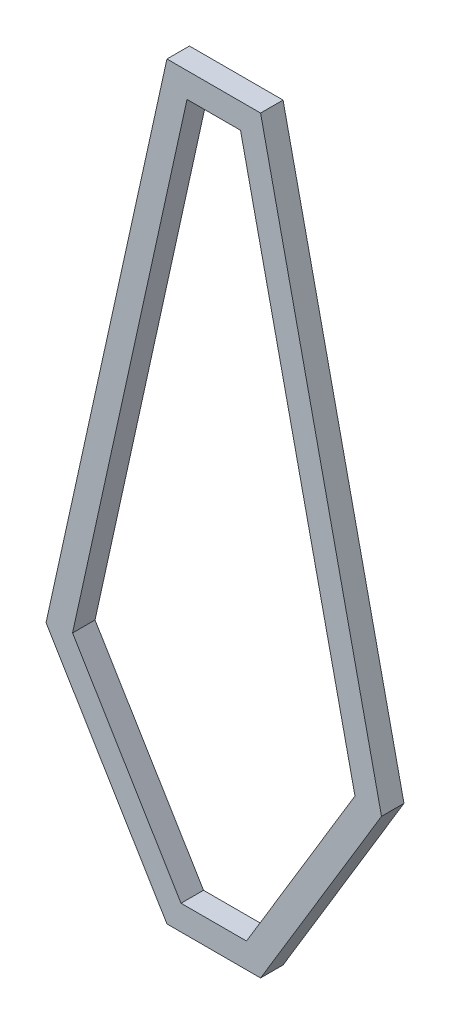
ISO-10303-21;
HEADER;
FILE_DESCRIPTION(('STEP AP214'),'2;1');
FILE_NAME('part.step','',(''),(''),'','','');
FILE_SCHEMA(('AUTOMOTIVE_DESIGN { 1 0 10303 214 1 1 1 1 }'));
ENDSEC;
DATA;
#1=APPLICATION_CONTEXT('core data for automotive mechanical design processes');
#2=APPLICATION_PROTOCOL_DEFINITION('international standard','automotive_design',2000,#1);
#3=PRODUCT_CONTEXT('',#1,'mechanical');
#4=PRODUCT('Part','Part','',(#3));
#5=PRODUCT_RELATED_PRODUCT_CATEGORY('part','',(#4));
#6=PRODUCT_DEFINITION_FORMATION('','',#4);
#7=PRODUCT_DEFINITION_CONTEXT('part definition',#1,'design');
#8=PRODUCT_DEFINITION('design','',#6,#7);
#9=PRODUCT_DEFINITION_SHAPE('','',#8);
#10=(LENGTH_UNIT() NAMED_UNIT(*) SI_UNIT(.MILLI.,.METRE.));
#11=(NAMED_UNIT(*) PLANE_ANGLE_UNIT() SI_UNIT($,.RADIAN.));
#12=(NAMED_UNIT(*) SI_UNIT($,.STERADIAN.) SOLID_ANGLE_UNIT());
#13=UNCERTAINTY_MEASURE_WITH_UNIT(LENGTH_MEASURE(1.E-05),#10,'distance_accuracy_value','');
#14=(GEOMETRIC_REPRESENTATION_CONTEXT(3) GLOBAL_UNCERTAINTY_ASSIGNED_CONTEXT((#13)) GLOBAL_UNIT_ASSIGNED_CONTEXT((#10,
#11,#12)) REPRESENTATION_CONTEXT('',''));
#15=CARTESIAN_POINT('',(0.,0.,0.));
#16=DIRECTION('',(0.,0.,1.));
#17=DIRECTION('',(1.,0.,0.));
#18=AXIS2_PLACEMENT_3D('',#15,#16,#17);
#19=CARTESIAN_POINT('',(-37.5,0.,18.));
#20=DIRECTION('',(0.9765625,-0.215234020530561,0.));
#21=DIRECTION('',(0.215234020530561,0.9765625,0.));
#22=AXIS2_PLACEMENT_3D('',#19,#20,#21);
#23=PLANE('',#22);
#24=DIRECTION('',(-0.215234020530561,-0.9765625,0.));
#25=VECTOR('',#24,1.);
#26=CARTESIAN_POINT('',(-37.5,0.,0.));
#27=LINE('',#26,#25);
#28=CARTESIAN_POINT('',(-37.5,0.,0.));
#29=VERTEX_POINT('',#28);
#30=CARTESIAN_POINT('',(-134.355309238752,-439.453125,0.));
#31=VERTEX_POINT('',#30);
#32=EDGE_CURVE('E169',#29,#31,#27,.T.);
#33=ORIENTED_EDGE('',*,*,#32,.T.);
#34=DIRECTION('',(0.,0.,-1.));
#35=VECTOR('',#34,1.);
#36=CARTESIAN_POINT('',(-134.355309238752,-439.453125,18.));
#37=LINE('',#36,#35);
#38=CARTESIAN_POINT('',(-134.355309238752,-439.453125,18.));
#39=VERTEX_POINT('',#38);
#40=EDGE_CURVE('E11',#39,#31,#37,.T.);
#41=ORIENTED_EDGE('',*,*,#40,.F.);
#42=DIRECTION('',(-0.215234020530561,-0.9765625,0.));
#43=VECTOR('',#42,1.);
#44=CARTESIAN_POINT('',(-37.5,0.,18.));
#45=LINE('',#44,#43);
#46=CARTESIAN_POINT('',(-37.5,0.,18.));
#47=VERTEX_POINT('',#46);
#48=EDGE_CURVE('E177',#47,#39,#45,.T.);
#49=ORIENTED_EDGE('',*,*,#48,.F.);
#50=DIRECTION('',(0.,0.,-1.));
#51=VECTOR('',#50,1.);
#52=CARTESIAN_POINT('',(-37.5,0.,18.));
#53=LINE('',#52,#51);
#54=EDGE_CURVE('E191',#47,#29,#53,.T.);
#55=ORIENTED_EDGE('',*,*,#54,.T.);
#56=EDGE_LOOP('',(#33,#41,#49,#55));
#57=FACE_BOUND('',#56,.T.);
#58=ADVANCED_FACE('F36',(#57),#23,.F.);
#59=CARTESIAN_POINT('',(-134.355309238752,-439.453125,18.));
#60=DIRECTION('',(0.85625,0.516561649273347,0.));
#61=DIRECTION('',(-0.516561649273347,0.85625,0.));
#62=AXIS2_PLACEMENT_3D('',#59,#60,#61);
#63=PLANE('',#62);
#64=DIRECTION('',(0.516561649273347,-0.85625,0.));
#65=VECTOR('',#64,1.);
#66=CARTESIAN_POINT('',(-134.355309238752,-439.453125,0.));
#67=LINE('',#66,#65);
#68=CARTESIAN_POINT('',(-37.4999999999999,-600.,0.));
#69=VERTEX_POINT('',#68);
#70=EDGE_CURVE('E194',#31,#69,#67,.T.);
#71=ORIENTED_EDGE('',*,*,#70,.T.);
#72=DIRECTION('',(0.,0.,-1.));
#73=VECTOR('',#72,1.);
#74=CARTESIAN_POINT('',(-37.4999999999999,-600.,18.));
#75=LINE('',#74,#73);
#76=CARTESIAN_POINT('',(-37.4999999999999,-600.,18.));
#77=VERTEX_POINT('',#76);
#78=EDGE_CURVE('E43',#77,#69,#75,.T.);
#79=ORIENTED_EDGE('',*,*,#78,.F.);
#80=DIRECTION('',(0.516561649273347,-0.85625,0.));
#81=VECTOR('',#80,1.);
#82=CARTESIAN_POINT('',(-134.355309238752,-439.453125,18.));
#83=LINE('',#82,#81);
#84=EDGE_CURVE('E180',#39,#77,#83,.T.);
#85=ORIENTED_EDGE('',*,*,#84,.F.);
#86=ORIENTED_EDGE('',*,*,#40,.T.);
#87=EDGE_LOOP('',(#71,#79,#85,#86));
#88=FACE_BOUND('',#87,.T.);
#89=ADVANCED_FACE('F239',(#88),#63,.F.);
#90=CARTESIAN_POINT('',(37.5000000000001,-600.,18.));
#91=DIRECTION('',(0.,1.,0.));
#92=DIRECTION('',(0.,0.,1.));
#93=AXIS2_PLACEMENT_3D('',#90,#91,#92);
#94=PLANE('',#93);
#95=DIRECTION('',(1.,0.,0.));
#96=VECTOR('',#95,1.);
#97=CARTESIAN_POINT('',(37.5000000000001,-600.,0.));
#98=LINE('',#97,#96);
#99=CARTESIAN_POINT('',(37.5000000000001,-600.,0.));
#100=VERTEX_POINT('',#99);
#101=EDGE_CURVE('E196',#69,#100,#98,.T.);
#102=ORIENTED_EDGE('',*,*,#101,.T.);
#103=DIRECTION('',(0.,0.,-1.));
#104=VECTOR('',#103,1.);
#105=CARTESIAN_POINT('',(37.5000000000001,-600.,18.));
#106=LINE('',#105,#104);
#107=CARTESIAN_POINT('',(37.5000000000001,-600.,18.));
#108=VERTEX_POINT('',#107);
#109=EDGE_CURVE('E211',#108,#100,#106,.T.);
#110=ORIENTED_EDGE('',*,*,#109,.F.);
#111=DIRECTION('',(1.,0.,0.));
#112=VECTOR('',#111,1.);
#113=CARTESIAN_POINT('',(37.5000000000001,-600.,18.));
#114=LINE('',#113,#112);
#115=EDGE_CURVE('E183',#77,#108,#114,.T.);
#116=ORIENTED_EDGE('',*,*,#115,.F.);
#117=ORIENTED_EDGE('',*,*,#78,.T.);
#118=EDGE_LOOP('',(#102,#110,#116,#117));
#119=FACE_BOUND('',#118,.T.);
#120=ADVANCED_FACE('F218',(#119),#94,.F.);
#121=CARTESIAN_POINT('',(134.355309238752,-439.453125,18.));
#122=DIRECTION('',(-0.85625,0.516561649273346,0.));
#123=DIRECTION('',(-0.516561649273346,-0.85625,0.));
#124=AXIS2_PLACEMENT_3D('',#121,#122,#123);
#125=PLANE('',#124);
#126=DIRECTION('',(0.516561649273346,0.85625,0.));
#127=VECTOR('',#126,1.);
#128=CARTESIAN_POINT('',(134.355309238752,-439.453125,0.));
#129=LINE('',#128,#127);
#130=CARTESIAN_POINT('',(134.355309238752,-439.453125,0.));
#131=VERTEX_POINT('',#130);
#132=EDGE_CURVE('E198',#100,#131,#129,.T.);
#133=ORIENTED_EDGE('',*,*,#132,.T.);
#134=DIRECTION('',(0.,0.,-1.));
#135=VECTOR('',#134,1.);
#136=CARTESIAN_POINT('',(134.355309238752,-439.453125,18.));
#137=LINE('',#136,#135);
#138=CARTESIAN_POINT('',(134.355309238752,-439.453125,18.));
#139=VERTEX_POINT('',#138);
#140=EDGE_CURVE('E208',#139,#131,#137,.T.);
#141=ORIENTED_EDGE('',*,*,#140,.F.);
#142=DIRECTION('',(0.516561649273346,0.85625,0.));
#143=VECTOR('',#142,1.);
#144=CARTESIAN_POINT('',(134.355309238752,-439.453125,18.));
#145=LINE('',#144,#143);
#146=EDGE_CURVE('E185',#108,#139,#145,.T.);
#147=ORIENTED_EDGE('',*,*,#146,.F.);
#148=ORIENTED_EDGE('',*,*,#109,.T.);
#149=EDGE_LOOP('',(#133,#141,#147,#148));
#150=FACE_BOUND('',#149,.T.);
#151=ADVANCED_FACE('F227',(#150),#125,.F.);
#152=CARTESIAN_POINT('',(37.5,0.,18.));
#153=DIRECTION('',(-0.9765625,-0.215234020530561,0.));
#154=DIRECTION('',(0.215234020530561,-0.9765625,0.));
#155=AXIS2_PLACEMENT_3D('',#152,#153,#154);
#156=PLANE('',#155);
#157=DIRECTION('',(-0.215234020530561,0.9765625,0.));
#158=VECTOR('',#157,1.);
#159=CARTESIAN_POINT('',(37.5,0.,0.));
#160=LINE('',#159,#158);
#161=CARTESIAN_POINT('',(37.5,0.,0.));
#162=VERTEX_POINT('',#161);
#163=EDGE_CURVE('E200',#131,#162,#160,.T.);
#164=ORIENTED_EDGE('',*,*,#163,.T.);
#165=DIRECTION('',(0.,0.,-1.));
#166=VECTOR('',#165,1.);
#167=CARTESIAN_POINT('',(37.5,0.,18.));
#168=LINE('',#167,#166);
#169=CARTESIAN_POINT('',(37.5,0.,18.));
#170=VERTEX_POINT('',#169);
#171=EDGE_CURVE('E205',#170,#162,#168,.T.);
#172=ORIENTED_EDGE('',*,*,#171,.F.);
#173=DIRECTION('',(-0.215234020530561,0.9765625,0.));
#174=VECTOR('',#173,1.);
#175=CARTESIAN_POINT('',(37.5,0.,18.));
#176=LINE('',#175,#174);
#177=EDGE_CURVE('E187',#139,#170,#176,.T.);
#178=ORIENTED_EDGE('',*,*,#177,.F.);
#179=ORIENTED_EDGE('',*,*,#140,.T.);
#180=EDGE_LOOP('',(#164,#172,#178,#179));
#181=FACE_BOUND('',#180,.T.);
#182=ADVANCED_FACE('F231',(#181),#156,.F.);
#183=CARTESIAN_POINT('',(37.5,0.,18.));
#184=DIRECTION('',(0.,-1.,0.));
#185=DIRECTION('',(1.,0.,0.));
#186=AXIS2_PLACEMENT_3D('',#183,#184,#185);
#187=PLANE('',#186);
#188=DIRECTION('',(-1.,0.,0.));
#189=VECTOR('',#188,1.);
#190=CARTESIAN_POINT('',(37.5,0.,0.));
#191=LINE('',#190,#189);
#192=EDGE_CURVE('E181',#162,#29,#191,.T.);
#193=ORIENTED_EDGE('',*,*,#192,.T.);
#194=ORIENTED_EDGE('',*,*,#54,.F.);
#195=DIRECTION('',(-1.,0.,0.));
#196=VECTOR('',#195,1.);
#197=CARTESIAN_POINT('',(37.5,0.,18.));
#198=LINE('',#197,#196);
#199=EDGE_CURVE('E189',#170,#47,#198,.T.);
#200=ORIENTED_EDGE('',*,*,#199,.F.);
#201=ORIENTED_EDGE('',*,*,#171,.T.);
#202=EDGE_LOOP('',(#193,#194,#200,#201));
#203=FACE_BOUND('',#202,.T.);
#204=ADVANCED_FACE('F242',(#203),#187,.F.);
#205=CARTESIAN_POINT('',(0.,0.,18.));
#206=DIRECTION('',(0.,0.,-1.));
#207=DIRECTION('',(-1.,0.,0.));
#208=AXIS2_PLACEMENT_3D('',#205,#206,#207);
#209=PLANE('',#208);
#210=DIRECTION('',(-0.215234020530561,-0.9765625,0.));
#211=VECTOR('',#210,1.);
#212=CARTESIAN_POINT('',(-21.4279927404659,-20.,18.));
#213=LINE('',#212,#211);
#214=CARTESIAN_POINT('',(-21.4279927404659,-20.,18.));
#215=VERTEX_POINT('',#214);
#216=CARTESIAN_POINT('',(-113.105309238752,-435.959471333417,18.));
#217=VERTEX_POINT('',#216);
#218=EDGE_CURVE('E157',#215,#217,#213,.T.);
#219=ORIENTED_EDGE('',*,*,#218,.F.);
#220=DIRECTION('',(-1.,0.,0.));
#221=VECTOR('',#220,1.);
#222=CARTESIAN_POINT('',(21.4279927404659,-20.,18.));
#223=LINE('',#222,#221);
#224=CARTESIAN_POINT('',(21.4279927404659,-20.,18.));
#225=VERTEX_POINT('',#224);
#226=EDGE_CURVE('E50',#225,#215,#223,.T.);
#227=ORIENTED_EDGE('',*,*,#226,.F.);
#228=DIRECTION('',(-0.215234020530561,0.9765625,0.));
#229=VECTOR('',#228,1.);
#230=CARTESIAN_POINT('',(113.105309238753,-435.959471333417,18.));
#231=LINE('',#230,#229);
#232=CARTESIAN_POINT('',(113.105309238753,-435.959471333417,18.));
#233=VERTEX_POINT('',#232);
#234=EDGE_CURVE('E143',#233,#225,#231,.T.);
#235=ORIENTED_EDGE('',*,*,#234,.F.);
#236=DIRECTION('',(0.516561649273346,0.85625,0.));
#237=VECTOR('',#236,1.);
#238=CARTESIAN_POINT('',(26.2080093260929,-580.,18.));
#239=LINE('',#238,#237);
#240=CARTESIAN_POINT('',(26.2080093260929,-580.,18.));
#241=VERTEX_POINT('',#240);
#242=EDGE_CURVE('E146',#241,#233,#239,.T.);
#243=ORIENTED_EDGE('',*,*,#242,.F.);
#244=DIRECTION('',(1.,0.,0.));
#245=VECTOR('',#244,1.);
#246=CARTESIAN_POINT('',(-26.2080093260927,-580.,18.));
#247=LINE('',#246,#245);
#248=CARTESIAN_POINT('',(-26.2080093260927,-580.,18.));
#249=VERTEX_POINT('',#248);
#250=EDGE_CURVE('E162',#249,#241,#247,.T.);
#251=ORIENTED_EDGE('',*,*,#250,.F.);
#252=DIRECTION('',(0.516561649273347,-0.85625,0.));
#253=VECTOR('',#252,1.);
#254=CARTESIAN_POINT('',(-113.105309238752,-435.959471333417,18.));
#255=LINE('',#254,#253);
#256=EDGE_CURVE('E159',#217,#249,#255,.T.);
#257=ORIENTED_EDGE('',*,*,#256,.F.);
#258=EDGE_LOOP('',(#219,#227,#235,#243,#251,#257));
#259=FACE_BOUND('',#258,.T.);
#260=ORIENTED_EDGE('',*,*,#48,.T.);
#261=ORIENTED_EDGE('',*,*,#84,.T.);
#262=ORIENTED_EDGE('',*,*,#115,.T.);
#263=ORIENTED_EDGE('',*,*,#146,.T.);
#264=ORIENTED_EDGE('',*,*,#177,.T.);
#265=ORIENTED_EDGE('',*,*,#199,.T.);
#266=EDGE_LOOP('',(#260,#261,#262,#263,#264,#265));
#267=FACE_BOUND('',#266,.T.);
#268=ADVANCED_FACE('F235',(#259,#267),#209,.F.);
#269=CARTESIAN_POINT('',(0.,0.,0.));
#270=DIRECTION('',(0.,0.,-1.));
#271=DIRECTION('',(-1.,0.,0.));
#272=AXIS2_PLACEMENT_3D('',#269,#270,#271);
#273=PLANE('',#272);
#274=DIRECTION('',(-1.,0.,0.));
#275=VECTOR('',#274,1.);
#276=CARTESIAN_POINT('',(21.4279927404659,-20.,0.));
#277=LINE('',#276,#275);
#278=CARTESIAN_POINT('',(21.4279927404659,-20.,0.));
#279=VERTEX_POINT('',#278);
#280=CARTESIAN_POINT('',(-21.4279927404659,-20.,0.));
#281=VERTEX_POINT('',#280);
#282=EDGE_CURVE('E126',#279,#281,#277,.T.);
#283=ORIENTED_EDGE('',*,*,#282,.T.);
#284=DIRECTION('',(-0.215234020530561,-0.9765625,0.));
#285=VECTOR('',#284,1.);
#286=CARTESIAN_POINT('',(-21.4279927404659,-20.,0.));
#287=LINE('',#286,#285);
#288=CARTESIAN_POINT('',(-113.105309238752,-435.959471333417,0.));
#289=VERTEX_POINT('',#288);
#290=EDGE_CURVE('E135',#281,#289,#287,.T.);
#291=ORIENTED_EDGE('',*,*,#290,.T.);
#292=DIRECTION('',(0.516561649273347,-0.85625,0.));
#293=VECTOR('',#292,1.);
#294=CARTESIAN_POINT('',(-113.105309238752,-435.959471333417,0.));
#295=LINE('',#294,#293);
#296=CARTESIAN_POINT('',(-26.2080093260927,-580.,0.));
#297=VERTEX_POINT('',#296);
#298=EDGE_CURVE('E58',#289,#297,#295,.T.);
#299=ORIENTED_EDGE('',*,*,#298,.T.);
#300=DIRECTION('',(1.,0.,0.));
#301=VECTOR('',#300,1.);
#302=CARTESIAN_POINT('',(-26.2080093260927,-580.,0.));
#303=LINE('',#302,#301);
#304=CARTESIAN_POINT('',(26.2080093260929,-580.,0.));
#305=VERTEX_POINT('',#304);
#306=EDGE_CURVE('E150',#297,#305,#303,.T.);
#307=ORIENTED_EDGE('',*,*,#306,.T.);
#308=DIRECTION('',(0.516561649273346,0.85625,0.));
#309=VECTOR('',#308,1.);
#310=CARTESIAN_POINT('',(26.2080093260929,-580.,0.));
#311=LINE('',#310,#309);
#312=CARTESIAN_POINT('',(113.105309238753,-435.959471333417,0.));
#313=VERTEX_POINT('',#312);
#314=EDGE_CURVE('E153',#305,#313,#311,.T.);
#315=ORIENTED_EDGE('',*,*,#314,.T.);
#316=DIRECTION('',(-0.215234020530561,0.9765625,0.));
#317=VECTOR('',#316,1.);
#318=CARTESIAN_POINT('',(113.105309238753,-435.959471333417,0.));
#319=LINE('',#318,#317);
#320=EDGE_CURVE('E132',#313,#279,#319,.T.);
#321=ORIENTED_EDGE('',*,*,#320,.T.);
#322=EDGE_LOOP('',(#283,#291,#299,#307,#315,#321));
#323=FACE_BOUND('',#322,.T.);
#324=ORIENTED_EDGE('',*,*,#32,.F.);
#325=ORIENTED_EDGE('',*,*,#192,.F.);
#326=ORIENTED_EDGE('',*,*,#163,.F.);
#327=ORIENTED_EDGE('',*,*,#132,.F.);
#328=ORIENTED_EDGE('',*,*,#101,.F.);
#329=ORIENTED_EDGE('',*,*,#70,.F.);
#330=EDGE_LOOP('',(#324,#325,#326,#327,#328,#329));
#331=FACE_BOUND('',#330,.T.);
#332=ADVANCED_FACE('F139',(#323,#331),#273,.T.);
#333=CARTESIAN_POINT('',(21.4279927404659,-20.,0.));
#334=DIRECTION('',(0.,1.,0.));
#335=DIRECTION('',(-1.,0.,0.));
#336=AXIS2_PLACEMENT_3D('',#333,#334,#335);
#337=PLANE('',#336);
#338=ORIENTED_EDGE('',*,*,#226,.T.);
#339=DIRECTION('',(0.,0.,1.));
#340=VECTOR('',#339,1.);
#341=CARTESIAN_POINT('',(-21.4279927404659,-20.,0.));
#342=LINE('',#341,#340);
#343=EDGE_CURVE('E122',#281,#215,#342,.T.);
#344=ORIENTED_EDGE('',*,*,#343,.F.);
#345=ORIENTED_EDGE('',*,*,#282,.F.);
#346=DIRECTION('',(0.,0.,1.));
#347=VECTOR('',#346,1.);
#348=CARTESIAN_POINT('',(21.4279927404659,-20.,0.));
#349=LINE('',#348,#347);
#350=EDGE_CURVE('E167',#279,#225,#349,.T.);
#351=ORIENTED_EDGE('',*,*,#350,.T.);
#352=EDGE_LOOP('',(#338,#344,#345,#351));
#353=FACE_BOUND('',#352,.T.);
#354=ADVANCED_FACE('F124',(#353),#337,.F.);
#355=CARTESIAN_POINT('',(113.105309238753,-435.959471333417,0.));
#356=DIRECTION('',(0.9765625,0.215234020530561,0.));
#357=DIRECTION('',(-0.215234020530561,0.9765625,0.));
#358=AXIS2_PLACEMENT_3D('',#355,#356,#357);
#359=PLANE('',#358);
#360=ORIENTED_EDGE('',*,*,#234,.T.);
#361=ORIENTED_EDGE('',*,*,#350,.F.);
#362=ORIENTED_EDGE('',*,*,#320,.F.);
#363=DIRECTION('',(0.,0.,1.));
#364=VECTOR('',#363,1.);
#365=CARTESIAN_POINT('',(113.105309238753,-435.959471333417,0.));
#366=LINE('',#365,#364);
#367=EDGE_CURVE('E170',#313,#233,#366,.T.);
#368=ORIENTED_EDGE('',*,*,#367,.T.);
#369=EDGE_LOOP('',(#360,#361,#362,#368));
#370=FACE_BOUND('',#369,.T.);
#371=ADVANCED_FACE('F297',(#370),#359,.F.);
#372=CARTESIAN_POINT('',(26.2080093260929,-580.,0.));
#373=DIRECTION('',(0.85625,-0.516561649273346,0.));
#374=DIRECTION('',(0.516561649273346,0.85625,0.));
#375=AXIS2_PLACEMENT_3D('',#372,#373,#374);
#376=PLANE('',#375);
#377=ORIENTED_EDGE('',*,*,#242,.T.);
#378=ORIENTED_EDGE('',*,*,#367,.F.);
#379=ORIENTED_EDGE('',*,*,#314,.F.);
#380=DIRECTION('',(0.,0.,1.));
#381=VECTOR('',#380,1.);
#382=CARTESIAN_POINT('',(26.2080093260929,-580.,0.));
#383=LINE('',#382,#381);
#384=EDGE_CURVE('E172',#305,#241,#383,.T.);
#385=ORIENTED_EDGE('',*,*,#384,.T.);
#386=EDGE_LOOP('',(#377,#378,#379,#385));
#387=FACE_BOUND('',#386,.T.);
#388=ADVANCED_FACE('F306',(#387),#376,.F.);
#389=CARTESIAN_POINT('',(-26.2080093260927,-580.,0.));
#390=DIRECTION('',(0.,-1.,0.));
#391=DIRECTION('',(0.,0.,-1.));
#392=AXIS2_PLACEMENT_3D('',#389,#390,#391);
#393=PLANE('',#392);
#394=ORIENTED_EDGE('',*,*,#250,.T.);
#395=ORIENTED_EDGE('',*,*,#384,.F.);
#396=ORIENTED_EDGE('',*,*,#306,.F.);
#397=DIRECTION('',(0.,0.,1.));
#398=VECTOR('',#397,1.);
#399=CARTESIAN_POINT('',(-26.2080093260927,-580.,0.));
#400=LINE('',#399,#398);
#401=EDGE_CURVE('E174',#297,#249,#400,.T.);
#402=ORIENTED_EDGE('',*,*,#401,.T.);
#403=EDGE_LOOP('',(#394,#395,#396,#402));
#404=FACE_BOUND('',#403,.T.);
#405=ADVANCED_FACE('F316',(#404),#393,.F.);
#406=CARTESIAN_POINT('',(-113.105309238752,-435.959471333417,0.));
#407=DIRECTION('',(-0.85625,-0.516561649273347,0.));
#408=DIRECTION('',(0.516561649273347,-0.85625,0.));
#409=AXIS2_PLACEMENT_3D('',#406,#407,#408);
#410=PLANE('',#409);
#411=ORIENTED_EDGE('',*,*,#256,.T.);
#412=ORIENTED_EDGE('',*,*,#401,.F.);
#413=ORIENTED_EDGE('',*,*,#298,.F.);
#414=DIRECTION('',(0.,0.,1.));
#415=VECTOR('',#414,1.);
#416=CARTESIAN_POINT('',(-113.105309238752,-435.959471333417,0.));
#417=LINE('',#416,#415);
#418=EDGE_CURVE('E131',#289,#217,#417,.T.);
#419=ORIENTED_EDGE('',*,*,#418,.T.);
#420=EDGE_LOOP('',(#411,#412,#413,#419));
#421=FACE_BOUND('',#420,.T.);
#422=ADVANCED_FACE('F326',(#421),#410,.F.);
#423=CARTESIAN_POINT('',(-21.4279927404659,-20.,0.));
#424=DIRECTION('',(-0.9765625,0.215234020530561,0.));
#425=DIRECTION('',(-0.215234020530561,-0.9765625,0.));
#426=AXIS2_PLACEMENT_3D('',#423,#424,#425);
#427=PLANE('',#426);
#428=ORIENTED_EDGE('',*,*,#218,.T.);
#429=ORIENTED_EDGE('',*,*,#418,.F.);
#430=ORIENTED_EDGE('',*,*,#290,.F.);
#431=ORIENTED_EDGE('',*,*,#343,.T.);
#432=EDGE_LOOP('',(#428,#429,#430,#431));
#433=FACE_BOUND('',#432,.T.);
#434=ADVANCED_FACE('F136',(#433),#427,.F.);
#435=CLOSED_SHELL('',(#58,#89,#120,#151,#182,#204,#268,#332,#354,#371,#388,#405,#422,#434));
#436=MANIFOLD_SOLID_BREP('B2',#435);
#437=ADVANCED_BREP_SHAPE_REPRESENTATION('',(#18,#436),#14);
#438=SHAPE_DEFINITION_REPRESENTATION(#9,#437);
ENDSEC;
END-ISO-10303-21;
